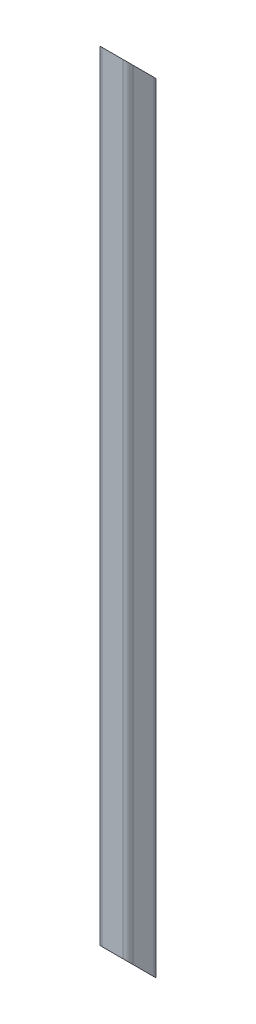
from build123d import *

# Parameters (mm, degrees)
EXTRUDE_THIN1_DEPTH = 990.6
EXTRUDE1_DEPTH      = 992.515442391


with BuildPart() as part:
    # Sketch1 → Extrude-Thin1 (new body)
    with BuildSketch(Plane(origin=(0, 0, 0), x_dir=(1, 0, 0), z_dir=(0, 1, 0))):
        with BuildLine():
            Line((-19.05, -12.97432), (-19.05, 12.97432))
            ThreePointArc((-19.05, 12.97432), (-17.270474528, 17.270474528), (-12.97432, 19.05))
            Line((-12.97432, 19.05), (12.97432, 19.05))
            ThreePointArc((12.97432, 19.05), (17.270474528, 17.270474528), (19.05, 12.97432))
            Line((19.05, 12.97432), (19.05, -12.97432))
            ThreePointArc((19.05, -12.97432), (17.270474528, -17.270474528), (12.97432, -19.05))
            Line((12.97432, -19.05), (-12.97432, -19.05))
            ThreePointArc((-12.97432, -19.05), (-17.270474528, -17.270474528), (-19.05, -12.97432))
        make_face()
        with BuildLine():
            Line((-16.01216, -12.97432), (-16.01216, 12.97432))
            ThreePointArc((-16.01216, 12.97432), (-15.122397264, 15.122397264), (-12.97432, 16.01216))
            Line((-12.97432, 16.01216), (12.97432, 16.01216))
            ThreePointArc((12.97432, 16.01216), (15.122397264, 15.122397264), (16.01216, 12.97432))
            Line((16.01216, 12.97432), (16.01216, -12.97432))
            ThreePointArc((16.01216, -12.97432), (15.122397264, -15.122397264), (12.97432, -16.01216))
            Line((12.97432, -16.01216), (-12.97432, -16.01216))
            ThreePointArc((-12.97432, -16.01216), (-15.122397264, -15.122397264), (-16.01216, -12.97432))
        make_face(mode=Mode.SUBTRACT)
    extrude(amount=EXTRUDE_THIN1_DEPTH)

    # Sketch2 → Extrude1 (cut, through all)
    with BuildSketch(Plane(origin=(19.05, 0, 0), x_dir=(0, 0, -1), z_dir=(1, 0, 0))):
        Polygon((-19.05, 990.6), (19.05, 952.5), (19.05, 990.6), align=None)
        Polygon((19.05, 0), (-19.05, 38.1), (-19.05, 0), align=None)
    extrude(amount=-EXTRUDE1_DEPTH, mode=Mode.SUBTRACT)


solid = part.part
